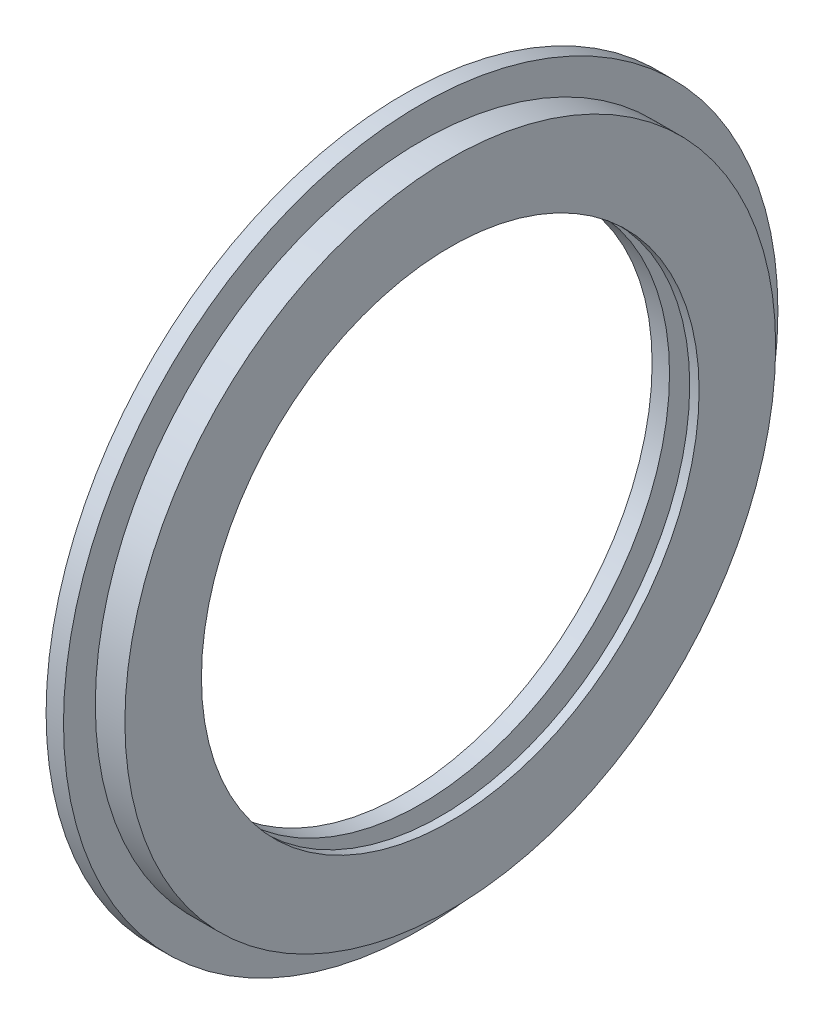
ISO-10303-21;
HEADER;
FILE_DESCRIPTION(('STEP AP214'),'2;1');
FILE_NAME('part.step','',(''),(''),'','','');
FILE_SCHEMA(('AUTOMOTIVE_DESIGN { 1 0 10303 214 1 1 1 1 }'));
ENDSEC;
DATA;
#1=APPLICATION_CONTEXT('core data for automotive mechanical design processes');
#2=APPLICATION_PROTOCOL_DEFINITION('international standard','automotive_design',2000,#1);
#3=PRODUCT_CONTEXT('',#1,'mechanical');
#4=PRODUCT('Part','Part','',(#3));
#5=PRODUCT_RELATED_PRODUCT_CATEGORY('part','',(#4));
#6=PRODUCT_DEFINITION_FORMATION('','',#4);
#7=PRODUCT_DEFINITION_CONTEXT('part definition',#1,'design');
#8=PRODUCT_DEFINITION('design','',#6,#7);
#9=PRODUCT_DEFINITION_SHAPE('','',#8);
#10=(LENGTH_UNIT() NAMED_UNIT(*) SI_UNIT(.MILLI.,.METRE.));
#11=(NAMED_UNIT(*) PLANE_ANGLE_UNIT() SI_UNIT($,.RADIAN.));
#12=(NAMED_UNIT(*) SI_UNIT($,.STERADIAN.) SOLID_ANGLE_UNIT());
#13=UNCERTAINTY_MEASURE_WITH_UNIT(LENGTH_MEASURE(1.E-05),#10,'distance_accuracy_value','');
#14=(GEOMETRIC_REPRESENTATION_CONTEXT(3) GLOBAL_UNCERTAINTY_ASSIGNED_CONTEXT((#13)) GLOBAL_UNIT_ASSIGNED_CONTEXT((#10,
#11,#12)) REPRESENTATION_CONTEXT('',''));
#15=CARTESIAN_POINT('',(0.,0.,0.));
#16=DIRECTION('',(0.,0.,1.));
#17=DIRECTION('',(1.,0.,0.));
#18=AXIS2_PLACEMENT_3D('',#15,#16,#17);
#19=CARTESIAN_POINT('',(8.3,52.5,49.8));
#20=DIRECTION('',(1.,0.,0.));
#21=DIRECTION('',(0.,1.,0.));
#22=AXIS2_PLACEMENT_3D('',#19,#20,#21);
#23=PLANE('',#22);
#24=CARTESIAN_POINT('',(8.3,52.5,33.3));
#25=DIRECTION('',(-1.,0.,0.));
#26=DIRECTION('',(0.,0.,1.));
#27=AXIS2_PLACEMENT_3D('',#24,#25,#26);
#28=CIRCLE('',#27,14.3);
#29=CARTESIAN_POINT('',(8.3,52.5,47.6));
#30=VERTEX_POINT('',#29);
#31=EDGE_CURVE('E10',#30,#30,#28,.T.);
#32=ORIENTED_EDGE('',*,*,#31,.T.);
#33=EDGE_LOOP('',(#32));
#34=FACE_BOUND('',#33,.T.);
#35=CARTESIAN_POINT('',(8.3,52.5,33.3));
#36=DIRECTION('',(-1.,0.,0.));
#37=DIRECTION('',(0.,0.,1.));
#38=AXIS2_PLACEMENT_3D('',#35,#36,#37);
#39=CIRCLE('',#38,18.7);
#40=CARTESIAN_POINT('',(8.3,52.5,52.));
#41=VERTEX_POINT('',#40);
#42=EDGE_CURVE('E31',#41,#41,#39,.T.);
#43=ORIENTED_EDGE('',*,*,#42,.F.);
#44=EDGE_LOOP('',(#43));
#45=FACE_BOUND('',#44,.T.);
#46=ADVANCED_FACE('F14',(#34,#45),#23,.T.);
#47=CARTESIAN_POINT('',(8.03,52.5,33.3));
#48=DIRECTION('',(1.,0.,0.));
#49=DIRECTION('',(0.,0.,1.));
#50=AXIS2_PLACEMENT_3D('',#47,#48,#49);
#51=CIRCLE('',#50,14.3);
#52=DIRECTION('',(-1.,0.,0.));
#53=VECTOR('',#52,1.);
#54=SURFACE_OF_LINEAR_EXTRUSION('',#51,#53);
#55=ORIENTED_EDGE('',*,*,#31,.F.);
#56=EDGE_LOOP('',(#55));
#57=FACE_BOUND('',#56,.T.);
#58=CARTESIAN_POINT('',(7.76,52.5,33.3));
#59=DIRECTION('',(-1.,0.,0.));
#60=DIRECTION('',(0.,0.,1.));
#61=AXIS2_PLACEMENT_3D('',#58,#59,#60);
#62=CIRCLE('',#61,14.3);
#63=CARTESIAN_POINT('',(7.76,52.5,47.6));
#64=VERTEX_POINT('',#63);
#65=EDGE_CURVE('E22',#64,#64,#62,.T.);
#66=ORIENTED_EDGE('',*,*,#65,.T.);
#67=EDGE_LOOP('',(#66));
#68=FACE_BOUND('',#67,.T.);
#69=ADVANCED_FACE('F54',(#57,#68),#54,.T.);
#70=CARTESIAN_POINT('',(7.76,52.5,49.55));
#71=DIRECTION('',(-1.,0.,0.));
#72=DIRECTION('',(0.,-1.,0.));
#73=AXIS2_PLACEMENT_3D('',#70,#71,#72);
#74=PLANE('',#73);
#75=CARTESIAN_POINT('',(7.76,52.5,33.3));
#76=DIRECTION('',(-1.,0.,0.));
#77=DIRECTION('',(0.,0.,1.));
#78=AXIS2_PLACEMENT_3D('',#75,#76,#77);
#79=CIRCLE('',#78,18.2);
#80=CARTESIAN_POINT('',(7.76,52.5,51.5));
#81=VERTEX_POINT('',#80);
#82=EDGE_CURVE('E27',#81,#81,#79,.T.);
#83=ORIENTED_EDGE('',*,*,#82,.T.);
#84=EDGE_LOOP('',(#83));
#85=FACE_BOUND('',#84,.T.);
#86=ORIENTED_EDGE('',*,*,#65,.F.);
#87=EDGE_LOOP('',(#86));
#88=FACE_BOUND('',#87,.T.);
#89=ADVANCED_FACE('F58',(#85,#88),#74,.T.);
#90=CARTESIAN_POINT('',(7.18,52.5,33.3));
#91=DIRECTION('',(1.,0.,0.));
#92=DIRECTION('',(0.,0.,1.));
#93=AXIS2_PLACEMENT_3D('',#90,#91,#92);
#94=CIRCLE('',#93,18.2);
#95=DIRECTION('',(-1.,0.,0.));
#96=VECTOR('',#95,1.);
#97=SURFACE_OF_LINEAR_EXTRUSION('',#94,#96);
#98=ORIENTED_EDGE('',*,*,#82,.F.);
#99=EDGE_LOOP('',(#98));
#100=FACE_BOUND('',#99,.T.);
#101=CARTESIAN_POINT('',(6.6,52.5,33.3));
#102=DIRECTION('',(-1.,0.,0.));
#103=DIRECTION('',(0.,0.,1.));
#104=AXIS2_PLACEMENT_3D('',#101,#102,#103);
#105=CIRCLE('',#104,18.2);
#106=CARTESIAN_POINT('',(6.6,52.5,51.5));
#107=VERTEX_POINT('',#106);
#108=EDGE_CURVE('E45',#107,#107,#105,.T.);
#109=ORIENTED_EDGE('',*,*,#108,.T.);
#110=EDGE_LOOP('',(#109));
#111=FACE_BOUND('',#110,.T.);
#112=ADVANCED_FACE('F62',(#100,#111),#97,.T.);
#113=CARTESIAN_POINT('',(6.6,52.5,49.55));
#114=DIRECTION('',(1.,0.,0.));
#115=DIRECTION('',(0.,1.,0.));
#116=AXIS2_PLACEMENT_3D('',#113,#114,#115);
#117=PLANE('',#116);
#118=CARTESIAN_POINT('',(6.6,52.5,33.3));
#119=DIRECTION('',(-1.,0.,0.));
#120=DIRECTION('',(0.,0.,1.));
#121=AXIS2_PLACEMENT_3D('',#118,#119,#120);
#122=CIRCLE('',#121,14.3);
#123=CARTESIAN_POINT('',(6.6,52.5,47.6));
#124=VERTEX_POINT('',#123);
#125=EDGE_CURVE('E33',#124,#124,#122,.T.);
#126=ORIENTED_EDGE('',*,*,#125,.T.);
#127=EDGE_LOOP('',(#126));
#128=FACE_BOUND('',#127,.T.);
#129=ORIENTED_EDGE('',*,*,#108,.F.);
#130=EDGE_LOOP('',(#129));
#131=FACE_BOUND('',#130,.T.);
#132=ADVANCED_FACE('F66',(#128,#131),#117,.T.);
#133=CARTESIAN_POINT('',(6.1,52.5,33.3));
#134=DIRECTION('',(1.,0.,0.));
#135=DIRECTION('',(0.,0.,1.));
#136=AXIS2_PLACEMENT_3D('',#133,#134,#135);
#137=CIRCLE('',#136,14.3);
#138=DIRECTION('',(-1.,0.,0.));
#139=VECTOR('',#138,1.);
#140=SURFACE_OF_LINEAR_EXTRUSION('',#137,#139);
#141=ORIENTED_EDGE('',*,*,#125,.F.);
#142=EDGE_LOOP('',(#141));
#143=FACE_BOUND('',#142,.T.);
#144=CARTESIAN_POINT('',(5.6,52.5,33.3));
#145=DIRECTION('',(-1.,0.,0.));
#146=DIRECTION('',(0.,0.,1.));
#147=AXIS2_PLACEMENT_3D('',#144,#145,#146);
#148=CIRCLE('',#147,14.3);
#149=CARTESIAN_POINT('',(5.6,52.5,47.6));
#150=VERTEX_POINT('',#149);
#151=EDGE_CURVE('E36',#150,#150,#148,.T.);
#152=ORIENTED_EDGE('',*,*,#151,.T.);
#153=EDGE_LOOP('',(#152));
#154=FACE_BOUND('',#153,.T.);
#155=ADVANCED_FACE('F70',(#143,#154),#140,.T.);
#156=CARTESIAN_POINT('',(5.6,52.5,50.71415));
#157=DIRECTION('',(-1.,0.,0.));
#158=DIRECTION('',(0.,-1.,0.));
#159=AXIS2_PLACEMENT_3D('',#156,#157,#158);
#160=PLANE('',#159);
#161=CARTESIAN_POINT('',(5.6,52.5,33.3));
#162=DIRECTION('',(-1.,0.,0.));
#163=DIRECTION('',(0.,0.,1.));
#164=AXIS2_PLACEMENT_3D('',#161,#162,#163);
#165=CIRCLE('',#164,20.5283);
#166=CARTESIAN_POINT('',(5.6,52.5,53.8283));
#167=VERTEX_POINT('',#166);
#168=EDGE_CURVE('E39',#167,#167,#165,.T.);
#169=ORIENTED_EDGE('',*,*,#168,.T.);
#170=EDGE_LOOP('',(#169));
#171=FACE_BOUND('',#170,.T.);
#172=ORIENTED_EDGE('',*,*,#151,.F.);
#173=EDGE_LOOP('',(#172));
#174=FACE_BOUND('',#173,.T.);
#175=ADVANCED_FACE('F74',(#171,#174),#160,.T.);
#176=CARTESIAN_POINT('',(6.1,52.5,33.3));
#177=DIRECTION('',(-1.,0.,0.));
#178=DIRECTION('',(0.,-1.,0.));
#179=AXIS2_PLACEMENT_3D('',#176,#177,#178);
#180=CYLINDRICAL_SURFACE('',#179,20.5283);
#181=CARTESIAN_POINT('',(6.6,52.5,33.3));
#182=DIRECTION('',(-1.,0.,0.));
#183=DIRECTION('',(0.,0.,1.));
#184=AXIS2_PLACEMENT_3D('',#181,#182,#183);
#185=CIRCLE('',#184,20.5283);
#186=CARTESIAN_POINT('',(6.6,52.5,53.8283));
#187=VERTEX_POINT('',#186);
#188=EDGE_CURVE('E42',#187,#187,#185,.T.);
#189=ORIENTED_EDGE('',*,*,#188,.T.);
#190=EDGE_LOOP('',(#189));
#191=FACE_BOUND('',#190,.T.);
#192=ORIENTED_EDGE('',*,*,#168,.F.);
#193=EDGE_LOOP('',(#192));
#194=FACE_BOUND('',#193,.T.);
#195=ADVANCED_FACE('F78',(#191,#194),#180,.T.);
#196=CARTESIAN_POINT('',(6.6,52.5,52.91415));
#197=DIRECTION('',(1.,0.,0.));
#198=DIRECTION('',(0.,1.,0.));
#199=AXIS2_PLACEMENT_3D('',#196,#197,#198);
#200=PLANE('',#199);
#201=CARTESIAN_POINT('',(6.6,52.5,33.3));
#202=DIRECTION('',(-1.,0.,0.));
#203=DIRECTION('',(0.,0.,1.));
#204=AXIS2_PLACEMENT_3D('',#201,#202,#203);
#205=CIRCLE('',#204,18.7);
#206=CARTESIAN_POINT('',(6.6,52.5,52.));
#207=VERTEX_POINT('',#206);
#208=EDGE_CURVE('E48',#207,#207,#205,.T.);
#209=ORIENTED_EDGE('',*,*,#208,.T.);
#210=EDGE_LOOP('',(#209));
#211=FACE_BOUND('',#210,.T.);
#212=ORIENTED_EDGE('',*,*,#188,.F.);
#213=EDGE_LOOP('',(#212));
#214=FACE_BOUND('',#213,.T.);
#215=ADVANCED_FACE('F81',(#211,#214),#200,.T.);
#216=CARTESIAN_POINT('',(7.45,52.5,33.3));
#217=DIRECTION('',(-1.,0.,0.));
#218=DIRECTION('',(0.,-1.,0.));
#219=AXIS2_PLACEMENT_3D('',#216,#217,#218);
#220=CYLINDRICAL_SURFACE('',#219,18.7);
#221=ORIENTED_EDGE('',*,*,#42,.T.);
#222=EDGE_LOOP('',(#221));
#223=FACE_BOUND('',#222,.T.);
#224=ORIENTED_EDGE('',*,*,#208,.F.);
#225=EDGE_LOOP('',(#224));
#226=FACE_BOUND('',#225,.T.);
#227=ADVANCED_FACE('F16',(#223,#226),#220,.T.);
#228=CLOSED_SHELL('',(#46,#69,#89,#112,#132,#155,#175,#195,#215,#227));
#229=MANIFOLD_SOLID_BREP('B1',#228);
#230=ADVANCED_BREP_SHAPE_REPRESENTATION('',(#18,#229),#14);
#231=SHAPE_DEFINITION_REPRESENTATION(#9,#230);
ENDSEC;
END-ISO-10303-21;
